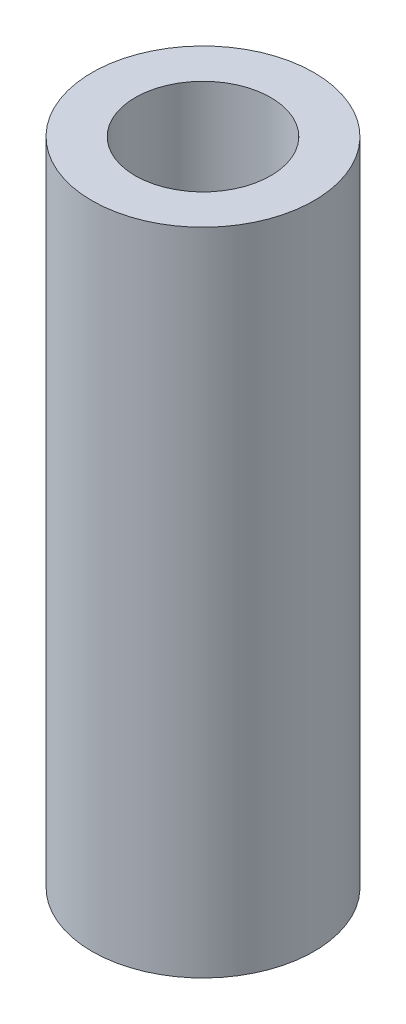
ISO-10303-21;
HEADER;
FILE_DESCRIPTION(('STEP AP214'),'2;1');
FILE_NAME('part.step','',(''),(''),'','','');
FILE_SCHEMA(('AUTOMOTIVE_DESIGN { 1 0 10303 214 1 1 1 1 }'));
ENDSEC;
DATA;
#1=APPLICATION_CONTEXT('core data for automotive mechanical design processes');
#2=APPLICATION_PROTOCOL_DEFINITION('international standard','automotive_design',2000,#1);
#3=PRODUCT_CONTEXT('',#1,'mechanical');
#4=PRODUCT('Part','Part','',(#3));
#5=PRODUCT_RELATED_PRODUCT_CATEGORY('part','',(#4));
#6=PRODUCT_DEFINITION_FORMATION('','',#4);
#7=PRODUCT_DEFINITION_CONTEXT('part definition',#1,'design');
#8=PRODUCT_DEFINITION('design','',#6,#7);
#9=PRODUCT_DEFINITION_SHAPE('','',#8);
#10=(LENGTH_UNIT() NAMED_UNIT(*) SI_UNIT(.MILLI.,.METRE.));
#11=(NAMED_UNIT(*) PLANE_ANGLE_UNIT() SI_UNIT($,.RADIAN.));
#12=(NAMED_UNIT(*) SI_UNIT($,.STERADIAN.) SOLID_ANGLE_UNIT());
#13=UNCERTAINTY_MEASURE_WITH_UNIT(LENGTH_MEASURE(1.E-05),#10,'distance_accuracy_value','');
#14=(GEOMETRIC_REPRESENTATION_CONTEXT(3) GLOBAL_UNCERTAINTY_ASSIGNED_CONTEXT((#13)) GLOBAL_UNIT_ASSIGNED_CONTEXT((#10,
#11,#12)) REPRESENTATION_CONTEXT('',''));
#15=CARTESIAN_POINT('',(0.,0.,0.));
#16=DIRECTION('',(0.,0.,1.));
#17=DIRECTION('',(1.,0.,0.));
#18=AXIS2_PLACEMENT_3D('',#15,#16,#17);
#19=CARTESIAN_POINT('',(0.,11.938,0.));
#20=DIRECTION('',(0.,1.,0.));
#21=DIRECTION('',(0.,0.,1.));
#22=AXIS2_PLACEMENT_3D('',#19,#20,#21);
#23=PLANE('',#22);
#24=CARTESIAN_POINT('',(0.,11.938,0.));
#25=DIRECTION('',(0.,1.,0.));
#26=DIRECTION('',(0.,0.,1.));
#27=AXIS2_PLACEMENT_3D('',#24,#25,#26);
#28=CIRCLE('',#27,4.0767);
#29=CARTESIAN_POINT('',(0.,11.938,4.0767));
#30=VERTEX_POINT('',#29);
#31=EDGE_CURVE('E10',#30,#30,#28,.T.);
#32=ORIENTED_EDGE('',*,*,#31,.T.);
#33=EDGE_LOOP('',(#32));
#34=FACE_BOUND('',#33,.T.);
#35=CARTESIAN_POINT('',(0.,11.938,0.));
#36=DIRECTION('',(0.,1.,0.));
#37=DIRECTION('',(0.,0.,1.));
#38=AXIS2_PLACEMENT_3D('',#35,#36,#37);
#39=CIRCLE('',#38,2.4892);
#40=CARTESIAN_POINT('',(0.,11.938,2.4892));
#41=VERTEX_POINT('',#40);
#42=EDGE_CURVE('E44',#41,#41,#39,.T.);
#43=ORIENTED_EDGE('',*,*,#42,.F.);
#44=EDGE_LOOP('',(#43));
#45=FACE_BOUND('',#44,.T.);
#46=ADVANCED_FACE('F33',(#34,#45),#23,.T.);
#47=CARTESIAN_POINT('',(0.,-11.938,0.));
#48=DIRECTION('',(0.,1.,0.));
#49=DIRECTION('',(0.,0.,1.));
#50=AXIS2_PLACEMENT_3D('',#47,#48,#49);
#51=PLANE('',#50);
#52=CARTESIAN_POINT('',(0.,-11.938,0.));
#53=DIRECTION('',(0.,1.,0.));
#54=DIRECTION('',(0.,0.,1.));
#55=AXIS2_PLACEMENT_3D('',#52,#53,#54);
#56=CIRCLE('',#55,4.0767);
#57=CARTESIAN_POINT('',(0.,-11.938,4.0767));
#58=VERTEX_POINT('',#57);
#59=EDGE_CURVE('E37',#58,#58,#56,.T.);
#60=ORIENTED_EDGE('',*,*,#59,.F.);
#61=EDGE_LOOP('',(#60));
#62=FACE_BOUND('',#61,.T.);
#63=CARTESIAN_POINT('',(0.,-11.938,0.));
#64=DIRECTION('',(0.,1.,0.));
#65=DIRECTION('',(0.,0.,1.));
#66=AXIS2_PLACEMENT_3D('',#63,#64,#65);
#67=CIRCLE('',#66,2.4892);
#68=CARTESIAN_POINT('',(0.,-11.938,2.4892));
#69=VERTEX_POINT('',#68);
#70=EDGE_CURVE('E46',#69,#69,#67,.T.);
#71=ORIENTED_EDGE('',*,*,#70,.T.);
#72=EDGE_LOOP('',(#71));
#73=FACE_BOUND('',#72,.T.);
#74=ADVANCED_FACE('F56',(#62,#73),#51,.F.);
#75=CARTESIAN_POINT('',(0.,11.938,0.));
#76=DIRECTION('',(0.,-1.,0.));
#77=DIRECTION('',(0.,0.,-1.));
#78=AXIS2_PLACEMENT_3D('',#75,#76,#77);
#79=CYLINDRICAL_SURFACE('',#78,4.0767);
#80=ORIENTED_EDGE('',*,*,#31,.F.);
#81=EDGE_LOOP('',(#80));
#82=FACE_BOUND('',#81,.T.);
#83=ORIENTED_EDGE('',*,*,#59,.T.);
#84=EDGE_LOOP('',(#83));
#85=FACE_BOUND('',#84,.T.);
#86=ADVANCED_FACE('F35',(#82,#85),#79,.T.);
#87=CARTESIAN_POINT('',(0.,11.938,0.));
#88=DIRECTION('',(0.,-1.,0.));
#89=DIRECTION('',(0.,0.,-1.));
#90=AXIS2_PLACEMENT_3D('',#87,#88,#89);
#91=CYLINDRICAL_SURFACE('',#90,2.4892);
#92=ORIENTED_EDGE('',*,*,#42,.T.);
#93=EDGE_LOOP('',(#92));
#94=FACE_BOUND('',#93,.T.);
#95=ORIENTED_EDGE('',*,*,#70,.F.);
#96=EDGE_LOOP('',(#95));
#97=FACE_BOUND('',#96,.T.);
#98=ADVANCED_FACE('F52',(#94,#97),#91,.F.);
#99=CLOSED_SHELL('',(#46,#74,#86,#98));
#100=MANIFOLD_SOLID_BREP('B2',#99);
#101=ADVANCED_BREP_SHAPE_REPRESENTATION('',(#18,#100),#14);
#102=SHAPE_DEFINITION_REPRESENTATION(#9,#101);
ENDSEC;
END-ISO-10303-21;
